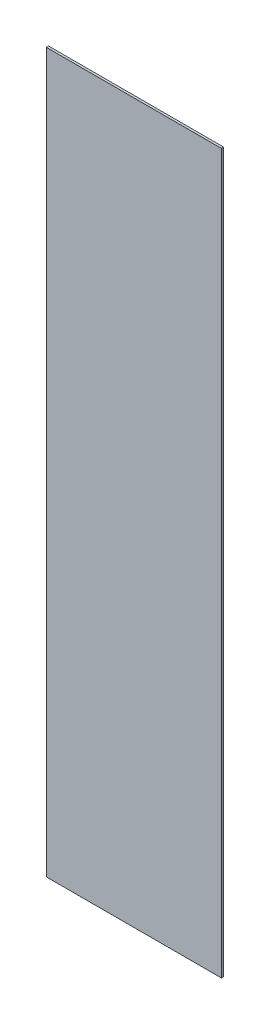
ISO-10303-21;
HEADER;
FILE_DESCRIPTION(('STEP AP214'),'2;1');
FILE_NAME('part.step','',(''),(''),'','','');
FILE_SCHEMA(('AUTOMOTIVE_DESIGN { 1 0 10303 214 1 1 1 1 }'));
ENDSEC;
DATA;
#1=APPLICATION_CONTEXT('core data for automotive mechanical design processes');
#2=APPLICATION_PROTOCOL_DEFINITION('international standard','automotive_design',2000,#1);
#3=PRODUCT_CONTEXT('',#1,'mechanical');
#4=PRODUCT('Part','Part','',(#3));
#5=PRODUCT_RELATED_PRODUCT_CATEGORY('part','',(#4));
#6=PRODUCT_DEFINITION_FORMATION('','',#4);
#7=PRODUCT_DEFINITION_CONTEXT('part definition',#1,'design');
#8=PRODUCT_DEFINITION('design','',#6,#7);
#9=PRODUCT_DEFINITION_SHAPE('','',#8);
#10=(LENGTH_UNIT() NAMED_UNIT(*) SI_UNIT(.MILLI.,.METRE.));
#11=(NAMED_UNIT(*) PLANE_ANGLE_UNIT() SI_UNIT($,.RADIAN.));
#12=(NAMED_UNIT(*) SI_UNIT($,.STERADIAN.) SOLID_ANGLE_UNIT());
#13=UNCERTAINTY_MEASURE_WITH_UNIT(LENGTH_MEASURE(1.E-05),#10,'distance_accuracy_value','');
#14=(GEOMETRIC_REPRESENTATION_CONTEXT(3) GLOBAL_UNCERTAINTY_ASSIGNED_CONTEXT((#13)) GLOBAL_UNIT_ASSIGNED_CONTEXT((#10,
#11,#12)) REPRESENTATION_CONTEXT('',''));
#15=CARTESIAN_POINT('',(0.,0.,0.));
#16=DIRECTION('',(0.,0.,1.));
#17=DIRECTION('',(1.,0.,0.));
#18=AXIS2_PLACEMENT_3D('',#15,#16,#17);
#19=CARTESIAN_POINT('',(79.375,254.,1.5875));
#20=DIRECTION('',(-1.,0.,0.));
#21=DIRECTION('',(0.,0.,1.));
#22=AXIS2_PLACEMENT_3D('',#19,#20,#21);
#23=PLANE('',#22);
#24=DIRECTION('',(0.,1.,0.));
#25=VECTOR('',#24,1.);
#26=CARTESIAN_POINT('',(79.375,254.,0.));
#27=LINE('',#26,#25);
#28=CARTESIAN_POINT('',(79.375,-254.,0.));
#29=VERTEX_POINT('',#28);
#30=CARTESIAN_POINT('',(79.375,254.,0.));
#31=VERTEX_POINT('',#30);
#32=EDGE_CURVE('E94',#29,#31,#27,.T.);
#33=ORIENTED_EDGE('',*,*,#32,.T.);
#34=DIRECTION('',(0.,0.,-1.));
#35=VECTOR('',#34,1.);
#36=CARTESIAN_POINT('',(79.375,254.,1.5875));
#37=LINE('',#36,#35);
#38=CARTESIAN_POINT('',(79.375,254.,1.5875));
#39=VERTEX_POINT('',#38);
#40=EDGE_CURVE('E11',#39,#31,#37,.T.);
#41=ORIENTED_EDGE('',*,*,#40,.F.);
#42=DIRECTION('',(0.,1.,0.));
#43=VECTOR('',#42,1.);
#44=CARTESIAN_POINT('',(79.375,254.,1.5875));
#45=LINE('',#44,#43);
#46=CARTESIAN_POINT('',(79.375,-254.,1.5875));
#47=VERTEX_POINT('',#46);
#48=EDGE_CURVE('E82',#47,#39,#45,.T.);
#49=ORIENTED_EDGE('',*,*,#48,.F.);
#50=DIRECTION('',(0.,0.,-1.));
#51=VECTOR('',#50,1.);
#52=CARTESIAN_POINT('',(79.375,-254.,1.5875));
#53=LINE('',#52,#51);
#54=EDGE_CURVE('E90',#47,#29,#53,.T.);
#55=ORIENTED_EDGE('',*,*,#54,.T.);
#56=EDGE_LOOP('',(#33,#41,#49,#55));
#57=FACE_BOUND('',#56,.T.);
#58=ADVANCED_FACE('F31',(#57),#23,.F.);
#59=CARTESIAN_POINT('',(79.375,254.,1.5875));
#60=DIRECTION('',(0.,-1.,0.));
#61=DIRECTION('',(0.,0.,-1.));
#62=AXIS2_PLACEMENT_3D('',#59,#60,#61);
#63=PLANE('',#62);
#64=DIRECTION('',(-1.,0.,0.));
#65=VECTOR('',#64,1.);
#66=CARTESIAN_POINT('',(79.375,254.,0.));
#67=LINE('',#66,#65);
#68=CARTESIAN_POINT('',(-44.4499999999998,254.,0.));
#69=VERTEX_POINT('',#68);
#70=EDGE_CURVE('E86',#31,#69,#67,.T.);
#71=ORIENTED_EDGE('',*,*,#70,.T.);
#72=DIRECTION('',(0.,0.,-1.));
#73=VECTOR('',#72,1.);
#74=CARTESIAN_POINT('',(-44.4499999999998,254.,1.5875));
#75=LINE('',#74,#73);
#76=CARTESIAN_POINT('',(-44.4499999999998,254.,1.5875));
#77=VERTEX_POINT('',#76);
#78=EDGE_CURVE('E39',#77,#69,#75,.T.);
#79=ORIENTED_EDGE('',*,*,#78,.F.);
#80=DIRECTION('',(-1.,0.,0.));
#81=VECTOR('',#80,1.);
#82=CARTESIAN_POINT('',(79.375,254.,1.5875));
#83=LINE('',#82,#81);
#84=EDGE_CURVE('E77',#39,#77,#83,.T.);
#85=ORIENTED_EDGE('',*,*,#84,.F.);
#86=ORIENTED_EDGE('',*,*,#40,.T.);
#87=EDGE_LOOP('',(#71,#79,#85,#86));
#88=FACE_BOUND('',#87,.T.);
#89=ADVANCED_FACE('F85',(#88),#63,.F.);
#90=CARTESIAN_POINT('',(-44.4499999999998,254.,1.5875));
#91=DIRECTION('',(1.,0.,0.));
#92=DIRECTION('',(0.,1.,0.));
#93=AXIS2_PLACEMENT_3D('',#90,#91,#92);
#94=PLANE('',#93);
#95=DIRECTION('',(0.,-1.,0.));
#96=VECTOR('',#95,1.);
#97=CARTESIAN_POINT('',(-44.4499999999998,254.,0.));
#98=LINE('',#97,#96);
#99=CARTESIAN_POINT('',(-44.4499999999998,-254.,0.));
#100=VERTEX_POINT('',#99);
#101=EDGE_CURVE('E64',#69,#100,#98,.T.);
#102=ORIENTED_EDGE('',*,*,#101,.T.);
#103=DIRECTION('',(0.,0.,-1.));
#104=VECTOR('',#103,1.);
#105=CARTESIAN_POINT('',(-44.4499999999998,-254.,1.5875));
#106=LINE('',#105,#104);
#107=CARTESIAN_POINT('',(-44.4499999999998,-254.,1.5875));
#108=VERTEX_POINT('',#107);
#109=EDGE_CURVE('E87',#108,#100,#106,.T.);
#110=ORIENTED_EDGE('',*,*,#109,.F.);
#111=DIRECTION('',(0.,-1.,0.));
#112=VECTOR('',#111,1.);
#113=CARTESIAN_POINT('',(-44.4499999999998,254.,1.5875));
#114=LINE('',#113,#112);
#115=EDGE_CURVE('E80',#77,#108,#114,.T.);
#116=ORIENTED_EDGE('',*,*,#115,.F.);
#117=ORIENTED_EDGE('',*,*,#78,.T.);
#118=EDGE_LOOP('',(#102,#110,#116,#117));
#119=FACE_BOUND('',#118,.T.);
#120=ADVANCED_FACE('F88',(#119),#94,.F.);
#121=CARTESIAN_POINT('',(79.375,-254.,1.5875));
#122=DIRECTION('',(0.,1.,0.));
#123=DIRECTION('',(0.,0.,1.));
#124=AXIS2_PLACEMENT_3D('',#121,#122,#123);
#125=PLANE('',#124);
#126=DIRECTION('',(1.,0.,0.));
#127=VECTOR('',#126,1.);
#128=CARTESIAN_POINT('',(79.375,-254.,0.));
#129=LINE('',#128,#127);
#130=EDGE_CURVE('E70',#100,#29,#129,.T.);
#131=ORIENTED_EDGE('',*,*,#130,.T.);
#132=ORIENTED_EDGE('',*,*,#54,.F.);
#133=DIRECTION('',(1.,0.,0.));
#134=VECTOR('',#133,1.);
#135=CARTESIAN_POINT('',(79.375,-254.,1.5875));
#136=LINE('',#135,#134);
#137=EDGE_CURVE('E47',#108,#47,#136,.T.);
#138=ORIENTED_EDGE('',*,*,#137,.F.);
#139=ORIENTED_EDGE('',*,*,#109,.T.);
#140=EDGE_LOOP('',(#131,#132,#138,#139));
#141=FACE_BOUND('',#140,.T.);
#142=ADVANCED_FACE('F101',(#141),#125,.F.);
#143=CARTESIAN_POINT('',(79.375,-254.,1.5875));
#144=DIRECTION('',(0.,0.,-1.));
#145=DIRECTION('',(-1.,0.,0.));
#146=AXIS2_PLACEMENT_3D('',#143,#144,#145);
#147=PLANE('',#146);
#148=ORIENTED_EDGE('',*,*,#48,.T.);
#149=ORIENTED_EDGE('',*,*,#84,.T.);
#150=ORIENTED_EDGE('',*,*,#115,.T.);
#151=ORIENTED_EDGE('',*,*,#137,.T.);
#152=EDGE_LOOP('',(#148,#149,#150,#151));
#153=FACE_BOUND('',#152,.T.);
#154=ADVANCED_FACE('F78',(#153),#147,.F.);
#155=CARTESIAN_POINT('',(79.375,-254.,0.));
#156=DIRECTION('',(0.,0.,-1.));
#157=DIRECTION('',(-1.,0.,0.));
#158=AXIS2_PLACEMENT_3D('',#155,#156,#157);
#159=PLANE('',#158);
#160=ORIENTED_EDGE('',*,*,#32,.F.);
#161=ORIENTED_EDGE('',*,*,#130,.F.);
#162=ORIENTED_EDGE('',*,*,#101,.F.);
#163=ORIENTED_EDGE('',*,*,#70,.F.);
#164=EDGE_LOOP('',(#160,#161,#162,#163));
#165=FACE_BOUND('',#164,.T.);
#166=ADVANCED_FACE('F104',(#165),#159,.T.);
#167=CLOSED_SHELL('',(#58,#89,#120,#142,#154,#166));
#168=MANIFOLD_SOLID_BREP('B2',#167);
#169=ADVANCED_BREP_SHAPE_REPRESENTATION('',(#18,#168),#14);
#170=SHAPE_DEFINITION_REPRESENTATION(#9,#169);
ENDSEC;
END-ISO-10303-21;
